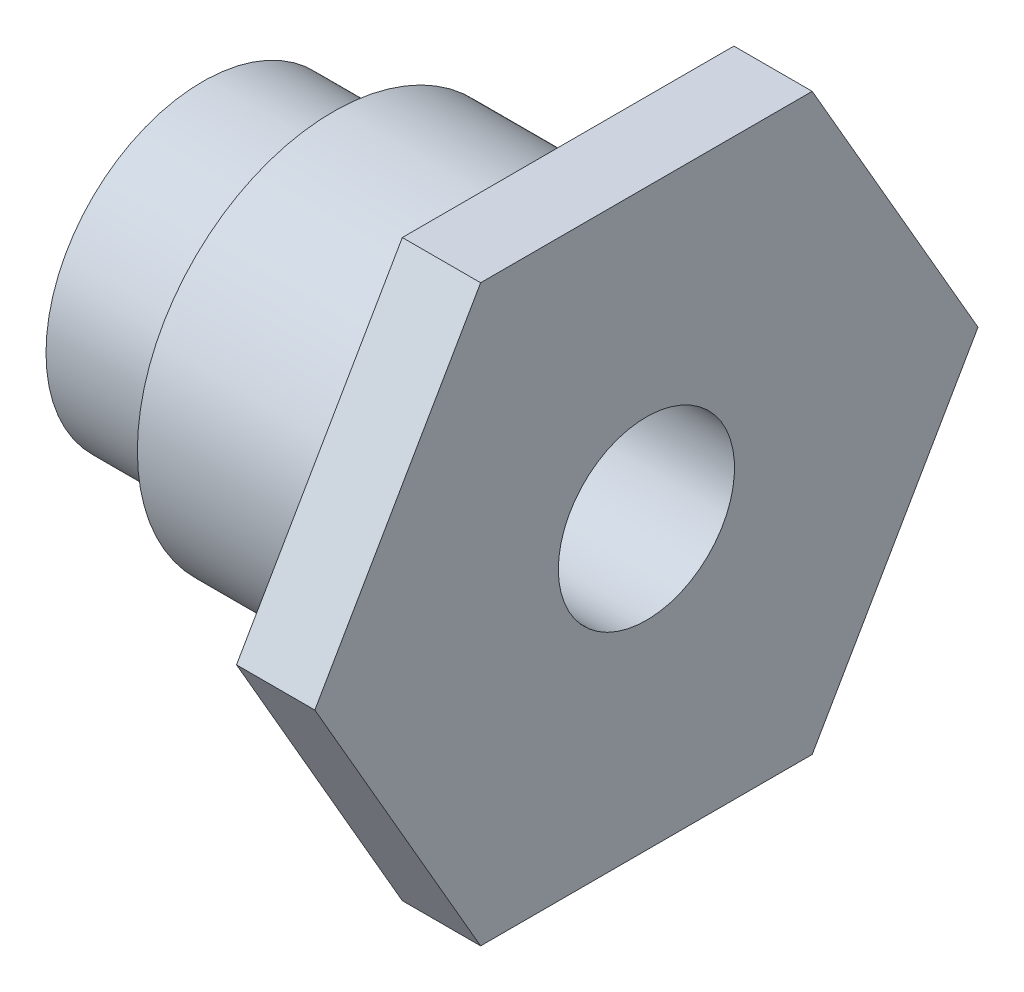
from build123d import *

# Parameters (mm, degrees)
ESQUISSE2_R             = 24.523611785
ENL_V_MAT_EXTRU_1_DEPTH = 31.024989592


with BuildPart() as part:
    # Esquisse1 → R_volution1 (revolve)
    with BuildSketch(Plane.XY, mode=Mode.PRIVATE) as r_volution1_sk:
        Polygon((0, 6), (5, 6), (5, 7.5), (14, 7.5), (14, 17.5), (17, 17.5), (17, 3.375), (0, 3.375), align=None)
    revolve(r_volution1_sk.sketch.rotate(Axis((0, 0, 0), (1, 0, 0)), 90), axis=Axis((0, 0, 0), (1, 0, 0)))

    # Esquisse2 → Enl_v. mat.-Extru.1 (cut, through all)
    with BuildSketch(Plane(origin=(17, 0, 0), x_dir=(0, 0, -1), z_dir=(1, 0, 0))):
        Circle(ESQUISSE2_R)
        Polygon((6.350852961, 11), (-6.350852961, 11), (-12.701705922, 0), (-6.350852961, -11), (6.350852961, -11), (12.701705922, 0), align=None, mode=Mode.SUBTRACT)
    extrude(amount=-ENL_V_MAT_EXTRU_1_DEPTH, mode=Mode.SUBTRACT)


solid = part.part
